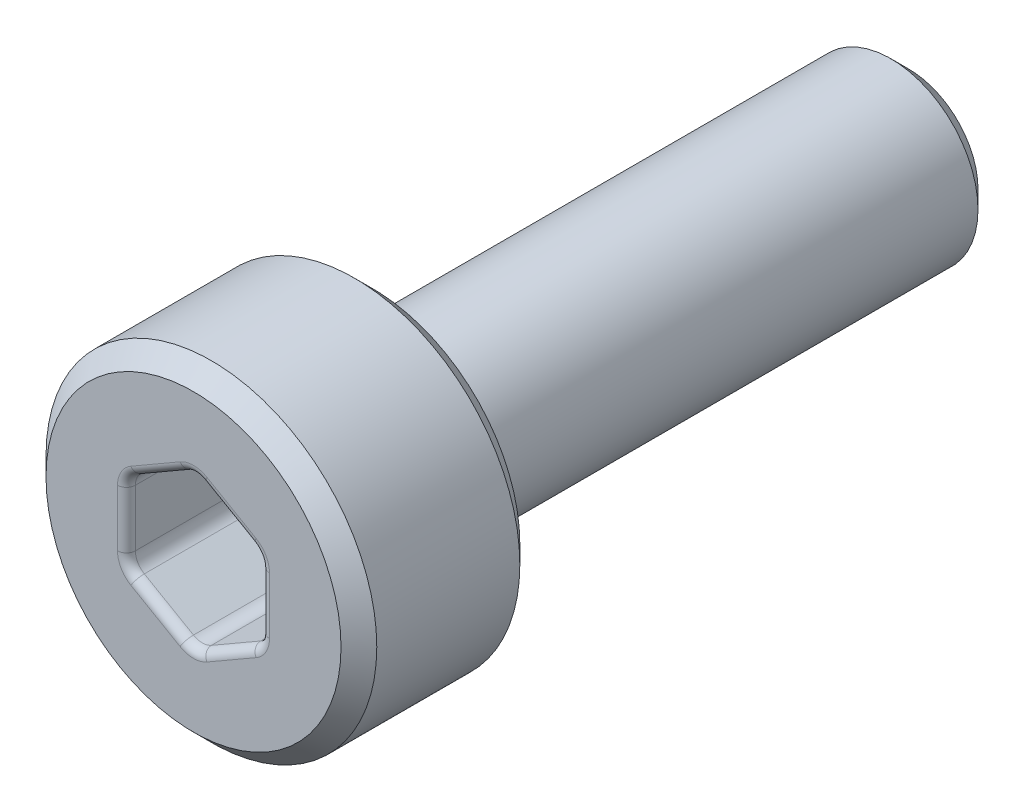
from build123d import *

# Parameters (mm, degrees)
SCHNITT_LINEAR_AUSTRAGEN1_DEPTH = 1.5
FASE1_SIZE                      = 0.2
VERRUNDUNG1_R                   = 0.2
VERRUNDUNG2_R                   = 0.1


with BuildPart() as part:
    # Skizze1 → Rotation1 (revolve)
    with BuildSketch(Plane(origin=(0, 0, 0), x_dir=(0, 0, -1), z_dir=(1, 0, 0)), mode=Mode.PRIVATE) as rotation1_sk:
        Polygon((-2, 0), (-2, 1.85), (0, 1.85), (0, 0.975), (6, 0.975), (6, 0), align=None)
    revolve(rotation1_sk.sketch.rotate(Axis((0, 0, 21.919879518), (0, 0, -1)), 90), axis=Axis((0, 0, 21.919879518), (0, 0, -1)))

    # Skizze2 → Schnitt-Linear austragen1 (cut)
    with BuildSketch(Plane.XY.offset(2)):
        Polygon((0.75, -0.433012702), (0.75, 0.433012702), (0, 0.866025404), (-0.75, 0.433012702), (-0.75, -0.433012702), (0, -0.866025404), align=None)
    extrude(amount=-SCHNITT_LINEAR_AUSTRAGEN1_DEPTH, mode=Mode.SUBTRACT)

    # Fase1
    fase1_edges = [part.edges().sort_by_distance(p)[0] for p in [
        (-0.975, 0, -6),
        (-1.85, 0, 0),
        (-1.85, 0, 2),
    ]]
    chamfer(fase1_edges, length=FASE1_SIZE)

    # Verrundung1
    verrundung1_edges = [part.edges().sort_by_distance(p)[0] for p in [
        (0.375, -0.649519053, 0.5),
        (0.75, -0.433012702, 1.25),
        (-0.375, -0.649519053, 0.5),
        (0, -0.866025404, 1.25),
        (-0.75, 0, 0.5),
        (-0.75, -0.433012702, 1.25),
        (-0.375, 0.649519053, 0.5),
        (-0.75, 0.433012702, 1.25),
        (0.375, 0.649519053, 0.5),
        (0, 0.866025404, 1.25),
        (0.75, 0, 0.5),
        (0.75, 0.433012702, 1.25),
        (-0.975, 0, 0),
    ]]
    fillet(verrundung1_edges, radius=VERRUNDUNG1_R)

    # Verrundung2
    verrundung2_edges = [part.edges().sort_by_distance(p)[0] for p in [
        (-0.375, -0.649519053, 2),
        (-0.75, 0, 2),
        (-0.375, 0.649519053, 2),
        (0.375, 0.649519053, 2),
        (0.75, 0, 2),
        (0.375, -0.649519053, 2),
        (-0.723205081, -0.417542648, 2),
        (0, -0.835085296, 2),
        (0.723205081, -0.417542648, 2),
        (0.723205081, 0.417542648, 2),
        (0, 0.835085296, 2),
        (-0.723205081, 0.417542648, 2),
    ]]
    fillet(verrundung2_edges, radius=VERRUNDUNG2_R)


solid = part.part
